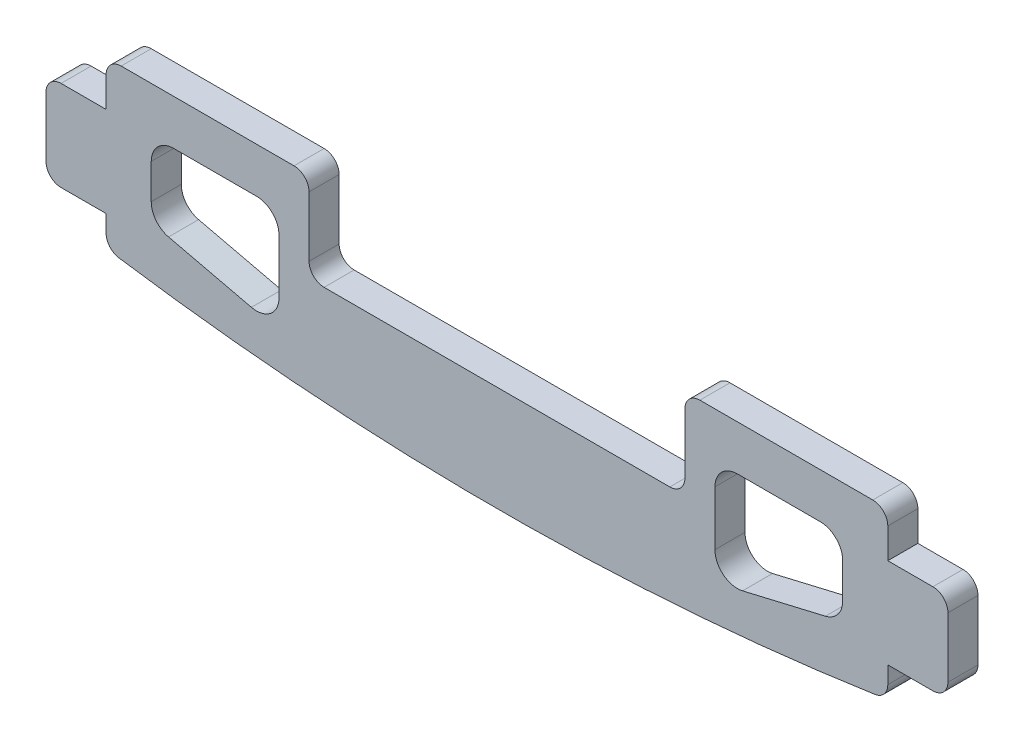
ISO-10303-21;
HEADER;
FILE_DESCRIPTION(('STEP AP214'),'2;1');
FILE_NAME('part.step','',(''),(''),'','','');
FILE_SCHEMA(('AUTOMOTIVE_DESIGN { 1 0 10303 214 1 1 1 1 }'));
ENDSEC;
DATA;
#1=APPLICATION_CONTEXT('core data for automotive mechanical design processes');
#2=APPLICATION_PROTOCOL_DEFINITION('international standard','automotive_design',2000,#1);
#3=PRODUCT_CONTEXT('',#1,'mechanical');
#4=PRODUCT('Part','Part','',(#3));
#5=PRODUCT_RELATED_PRODUCT_CATEGORY('part','',(#4));
#6=PRODUCT_DEFINITION_FORMATION('','',#4);
#7=PRODUCT_DEFINITION_CONTEXT('part definition',#1,'design');
#8=PRODUCT_DEFINITION('design','',#6,#7);
#9=PRODUCT_DEFINITION_SHAPE('','',#8);
#10=(LENGTH_UNIT() NAMED_UNIT(*) SI_UNIT(.MILLI.,.METRE.));
#11=(NAMED_UNIT(*) PLANE_ANGLE_UNIT() SI_UNIT($,.RADIAN.));
#12=(NAMED_UNIT(*) SI_UNIT($,.STERADIAN.) SOLID_ANGLE_UNIT());
#13=UNCERTAINTY_MEASURE_WITH_UNIT(LENGTH_MEASURE(1.E-05),#10,'distance_accuracy_value','');
#14=(GEOMETRIC_REPRESENTATION_CONTEXT(3) GLOBAL_UNCERTAINTY_ASSIGNED_CONTEXT((#13)) GLOBAL_UNIT_ASSIGNED_CONTEXT((#10,
#11,#12)) REPRESENTATION_CONTEXT('',''));
#15=CARTESIAN_POINT('',(0.,0.,0.));
#16=DIRECTION('',(0.,0.,1.));
#17=DIRECTION('',(1.,0.,0.));
#18=AXIS2_PLACEMENT_3D('',#15,#16,#17);
#19=CARTESIAN_POINT('',(29.,2.,2.));
#20=DIRECTION('',(0.,0.,-1.));
#21=DIRECTION('',(-1.,0.,0.));
#22=AXIS2_PLACEMENT_3D('',#19,#20,#21);
#23=PLANE('',#22);
#24=CARTESIAN_POINT('',(21.5059690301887,1.50596903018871,2.));
#25=DIRECTION('',(0.,0.,1.));
#26=DIRECTION('',(-1.,0.,0.));
#27=AXIS2_PLACEMENT_3D('',#24,#25,#26);
#28=CIRCLE('',#27,1.49403096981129);
#29=CARTESIAN_POINT('',(23.,1.5059690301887,2.));
#30=VERTEX_POINT('',#29);
#31=CARTESIAN_POINT('',(21.5059690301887,3.,2.));
#32=VERTEX_POINT('',#31);
#33=EDGE_CURVE('E378',#30,#32,#28,.T.);
#34=ORIENTED_EDGE('',*,*,#33,.F.);
#35=DIRECTION('',(0.,1.,0.));
#36=VECTOR('',#35,1.);
#37=CARTESIAN_POINT('',(23.,1.5059690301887,2.));
#38=LINE('',#37,#36);
#39=CARTESIAN_POINT('',(23.,-0.816705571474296,2.));
#40=VERTEX_POINT('',#39);
#41=EDGE_CURVE('E394',#40,#30,#38,.T.);
#42=ORIENTED_EDGE('',*,*,#41,.F.);
#43=CARTESIAN_POINT('',(21.5059690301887,-0.816705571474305,2.));
#44=DIRECTION('',(0.,0.,1.));
#45=DIRECTION('',(-1.,0.,0.));
#46=AXIS2_PLACEMENT_3D('',#43,#44,#45);
#47=CIRCLE('',#46,1.49403096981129);
#48=CARTESIAN_POINT('',(21.8481608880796,-2.27102096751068,2.));
#49=VERTEX_POINT('',#48);
#50=EDGE_CURVE('E391',#49,#40,#47,.T.);
#51=ORIENTED_EDGE('',*,*,#50,.F.);
#52=DIRECTION('',(0.973417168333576,0.229039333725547,0.));
#53=VECTOR('',#52,1.);
#54=CARTESIAN_POINT('',(21.8481608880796,-2.27102096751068,2.));
#55=LINE('',#54,#53);
#56=CARTESIAN_POINT('',(16.3362228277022,-3.56794756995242,2.));
#57=VERTEX_POINT('',#56);
#58=EDGE_CURVE('E389',#57,#49,#55,.T.);
#59=ORIENTED_EDGE('',*,*,#58,.F.);
#60=CARTESIAN_POINT('',(15.9940309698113,-2.11363217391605,2.));
#61=DIRECTION('',(0.,0.,1.));
#62=DIRECTION('',(-1.,0.,0.));
#63=AXIS2_PLACEMENT_3D('',#60,#61,#62);
#64=CIRCLE('',#63,1.49403096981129);
#65=CARTESIAN_POINT('',(14.5,-2.11363217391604,2.));
#66=VERTEX_POINT('',#65);
#67=EDGE_CURVE('E387',#66,#57,#64,.T.);
#68=ORIENTED_EDGE('',*,*,#67,.F.);
#69=DIRECTION('',(0.,-1.,0.));
#70=VECTOR('',#69,1.);
#71=CARTESIAN_POINT('',(14.5,-2.11363217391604,2.));
#72=LINE('',#71,#70);
#73=CARTESIAN_POINT('',(14.5,1.5059690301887,2.));
#74=VERTEX_POINT('',#73);
#75=EDGE_CURVE('E385',#74,#66,#72,.T.);
#76=ORIENTED_EDGE('',*,*,#75,.F.);
#77=CARTESIAN_POINT('',(15.9940309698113,1.50596903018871,2.));
#78=DIRECTION('',(0.,0.,1.));
#79=DIRECTION('',(1.,0.,0.));
#80=AXIS2_PLACEMENT_3D('',#77,#78,#79);
#81=CIRCLE('',#80,1.49403096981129);
#82=CARTESIAN_POINT('',(15.9940309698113,3.,2.));
#83=VERTEX_POINT('',#82);
#84=EDGE_CURVE('E383',#83,#74,#81,.T.);
#85=ORIENTED_EDGE('',*,*,#84,.F.);
#86=DIRECTION('',(-1.,0.,0.));
#87=VECTOR('',#86,1.);
#88=CARTESIAN_POINT('',(15.9940309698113,3.,2.));
#89=LINE('',#88,#87);
#90=EDGE_CURVE('E380',#32,#83,#89,.T.);
#91=ORIENTED_EDGE('',*,*,#90,.F.);
#92=EDGE_LOOP('',(#34,#42,#51,#59,#68,#76,#85,#91));
#93=FACE_BOUND('',#92,.T.);
#94=DIRECTION('',(-1.,0.,0.));
#95=VECTOR('',#94,1.);
#96=CARTESIAN_POINT('',(26.,3.,2.));
#97=LINE('',#96,#95);
#98=CARTESIAN_POINT('',(29.,3.,2.));
#99=VERTEX_POINT('',#98);
#100=CARTESIAN_POINT('',(26.,3.,2.));
#101=VERTEX_POINT('',#100);
#102=EDGE_CURVE('E437',#99,#101,#97,.T.);
#103=ORIENTED_EDGE('',*,*,#102,.T.);
#104=DIRECTION('',(0.,1.,0.));
#105=VECTOR('',#104,1.);
#106=CARTESIAN_POINT('',(26.,4.99999999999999,2.));
#107=LINE('',#106,#105);
#108=CARTESIAN_POINT('',(26.,4.99999999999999,2.));
#109=VERTEX_POINT('',#108);
#110=EDGE_CURVE('E440',#101,#109,#107,.T.);
#111=ORIENTED_EDGE('',*,*,#110,.T.);
#112=CARTESIAN_POINT('',(25.,5.,2.));
#113=DIRECTION('',(0.,0.,1.));
#114=DIRECTION('',(-1.,0.,0.));
#115=AXIS2_PLACEMENT_3D('',#112,#113,#114);
#116=CIRCLE('',#115,1.);
#117=CARTESIAN_POINT('',(25.,6.,2.));
#118=VERTEX_POINT('',#117);
#119=EDGE_CURVE('E443',#109,#118,#116,.T.);
#120=ORIENTED_EDGE('',*,*,#119,.T.);
#121=DIRECTION('',(-1.,0.,0.));
#122=VECTOR('',#121,1.);
#123=CARTESIAN_POINT('',(13.5,6.,2.));
#124=LINE('',#123,#122);
#125=CARTESIAN_POINT('',(13.5,6.,2.));
#126=VERTEX_POINT('',#125);
#127=EDGE_CURVE('E445',#118,#126,#124,.T.);
#128=ORIENTED_EDGE('',*,*,#127,.T.);
#129=CARTESIAN_POINT('',(13.5,5.,2.));
#130=DIRECTION('',(0.,0.,1.));
#131=DIRECTION('',(-1.,0.,0.));
#132=AXIS2_PLACEMENT_3D('',#129,#130,#131);
#133=CIRCLE('',#132,1.);
#134=CARTESIAN_POINT('',(12.5,4.99999999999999,2.));
#135=VERTEX_POINT('',#134);
#136=EDGE_CURVE('E447',#126,#135,#133,.T.);
#137=ORIENTED_EDGE('',*,*,#136,.T.);
#138=DIRECTION('',(0.,-1.,0.));
#139=VECTOR('',#138,1.);
#140=CARTESIAN_POINT('',(12.5,1.00000000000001,2.));
#141=LINE('',#140,#139);
#142=CARTESIAN_POINT('',(12.5,1.00000000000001,2.));
#143=VERTEX_POINT('',#142);
#144=EDGE_CURVE('E449',#135,#143,#141,.T.);
#145=ORIENTED_EDGE('',*,*,#144,.T.);
#146=CARTESIAN_POINT('',(11.5,1.,2.));
#147=DIRECTION('',(0.,0.,-1.));
#148=DIRECTION('',(1.,0.,0.));
#149=AXIS2_PLACEMENT_3D('',#146,#147,#148);
#150=CIRCLE('',#149,1.);
#151=CARTESIAN_POINT('',(11.5,0.,2.));
#152=VERTEX_POINT('',#151);
#153=EDGE_CURVE('E451',#143,#152,#150,.T.);
#154=ORIENTED_EDGE('',*,*,#153,.T.);
#155=DIRECTION('',(-1.,0.,0.));
#156=VECTOR('',#155,1.);
#157=CARTESIAN_POINT('',(-11.5,0.,2.));
#158=LINE('',#157,#156);
#159=CARTESIAN_POINT('',(-11.5,0.,2.));
#160=VERTEX_POINT('',#159);
#161=EDGE_CURVE('E453',#152,#160,#158,.T.);
#162=ORIENTED_EDGE('',*,*,#161,.T.);
#163=CARTESIAN_POINT('',(-11.5,1.,2.));
#164=DIRECTION('',(0.,0.,-1.));
#165=DIRECTION('',(-1.,0.,0.));
#166=AXIS2_PLACEMENT_3D('',#163,#164,#165);
#167=CIRCLE('',#166,1.);
#168=CARTESIAN_POINT('',(-12.5,1.00000000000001,2.));
#169=VERTEX_POINT('',#168);
#170=EDGE_CURVE('E455',#160,#169,#167,.T.);
#171=ORIENTED_EDGE('',*,*,#170,.T.);
#172=DIRECTION('',(0.,1.,0.));
#173=VECTOR('',#172,1.);
#174=CARTESIAN_POINT('',(-12.5,1.00000000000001,2.));
#175=LINE('',#174,#173);
#176=CARTESIAN_POINT('',(-12.5,4.99999999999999,2.));
#177=VERTEX_POINT('',#176);
#178=EDGE_CURVE('E457',#169,#177,#175,.T.);
#179=ORIENTED_EDGE('',*,*,#178,.T.);
#180=CARTESIAN_POINT('',(-13.5,5.,2.));
#181=DIRECTION('',(0.,0.,1.));
#182=DIRECTION('',(1.,0.,0.));
#183=AXIS2_PLACEMENT_3D('',#180,#181,#182);
#184=CIRCLE('',#183,1.);
#185=CARTESIAN_POINT('',(-13.5,6.,2.));
#186=VERTEX_POINT('',#185);
#187=EDGE_CURVE('E459',#177,#186,#184,.T.);
#188=ORIENTED_EDGE('',*,*,#187,.T.);
#189=DIRECTION('',(-1.,0.,0.));
#190=VECTOR('',#189,1.);
#191=CARTESIAN_POINT('',(-13.5,6.,2.));
#192=LINE('',#191,#190);
#193=CARTESIAN_POINT('',(-25.,6.,2.));
#194=VERTEX_POINT('',#193);
#195=EDGE_CURVE('E461',#186,#194,#192,.T.);
#196=ORIENTED_EDGE('',*,*,#195,.T.);
#197=CARTESIAN_POINT('',(-25.,5.,2.));
#198=DIRECTION('',(0.,0.,1.));
#199=DIRECTION('',(1.,0.,0.));
#200=AXIS2_PLACEMENT_3D('',#197,#198,#199);
#201=CIRCLE('',#200,1.);
#202=CARTESIAN_POINT('',(-26.,4.99999999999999,2.));
#203=VERTEX_POINT('',#202);
#204=EDGE_CURVE('E463',#194,#203,#201,.T.);
#205=ORIENTED_EDGE('',*,*,#204,.T.);
#206=DIRECTION('',(0.,-1.,0.));
#207=VECTOR('',#206,1.);
#208=CARTESIAN_POINT('',(-26.,4.99999999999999,2.));
#209=LINE('',#208,#207);
#210=CARTESIAN_POINT('',(-26.,3.,2.));
#211=VERTEX_POINT('',#210);
#212=EDGE_CURVE('E465',#203,#211,#209,.T.);
#213=ORIENTED_EDGE('',*,*,#212,.T.);
#214=DIRECTION('',(-1.,0.,0.));
#215=VECTOR('',#214,1.);
#216=CARTESIAN_POINT('',(-26.,3.,2.));
#217=LINE('',#216,#215);
#218=CARTESIAN_POINT('',(-29.,3.,2.));
#219=VERTEX_POINT('',#218);
#220=EDGE_CURVE('E467',#211,#219,#217,.T.);
#221=ORIENTED_EDGE('',*,*,#220,.T.);
#222=CARTESIAN_POINT('',(-29.,2.,2.));
#223=DIRECTION('',(0.,0.,1.));
#224=DIRECTION('',(1.,0.,0.));
#225=AXIS2_PLACEMENT_3D('',#222,#223,#224);
#226=CIRCLE('',#225,1.);
#227=CARTESIAN_POINT('',(-30.,1.99999999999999,2.));
#228=VERTEX_POINT('',#227);
#229=EDGE_CURVE('E469',#219,#228,#226,.T.);
#230=ORIENTED_EDGE('',*,*,#229,.T.);
#231=DIRECTION('',(0.,-1.,0.));
#232=VECTOR('',#231,1.);
#233=CARTESIAN_POINT('',(-30.,1.99999999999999,2.));
#234=LINE('',#233,#232);
#235=CARTESIAN_POINT('',(-30.,-1.99999999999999,2.));
#236=VERTEX_POINT('',#235);
#237=EDGE_CURVE('E471',#228,#236,#234,.T.);
#238=ORIENTED_EDGE('',*,*,#237,.T.);
#239=CARTESIAN_POINT('',(-29.,-2.,2.));
#240=DIRECTION('',(0.,0.,1.));
#241=DIRECTION('',(1.,0.,0.));
#242=AXIS2_PLACEMENT_3D('',#239,#240,#241);
#243=CIRCLE('',#242,1.);
#244=CARTESIAN_POINT('',(-29.,-3.,2.));
#245=VERTEX_POINT('',#244);
#246=EDGE_CURVE('E473',#236,#245,#243,.T.);
#247=ORIENTED_EDGE('',*,*,#246,.T.);
#248=DIRECTION('',(1.,0.,0.));
#249=VECTOR('',#248,1.);
#250=CARTESIAN_POINT('',(-29.,-3.,2.));
#251=LINE('',#250,#249);
#252=CARTESIAN_POINT('',(-26.,-3.,2.));
#253=VERTEX_POINT('',#252);
#254=EDGE_CURVE('E475',#245,#253,#251,.T.);
#255=ORIENTED_EDGE('',*,*,#254,.T.);
#256=DIRECTION('',(0.,-1.,0.));
#257=VECTOR('',#256,1.);
#258=CARTESIAN_POINT('',(-26.,-3.,2.));
#259=LINE('',#258,#257);
#260=CARTESIAN_POINT('',(-26.,-4.14065932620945,2.));
#261=VERTEX_POINT('',#260);
#262=EDGE_CURVE('E477',#253,#261,#259,.T.);
#263=ORIENTED_EDGE('',*,*,#262,.T.);
#264=CARTESIAN_POINT('',(-25.,-4.14065932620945,2.));
#265=DIRECTION('',(0.,0.,1.));
#266=DIRECTION('',(1.,0.,0.));
#267=AXIS2_PLACEMENT_3D('',#264,#265,#266);
#268=CIRCLE('',#267,1.);
#269=CARTESIAN_POINT('',(-25.1479289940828,-5.1296573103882,2.));
#270=VERTEX_POINT('',#269);
#271=EDGE_CURVE('E479',#261,#270,#268,.T.);
#272=ORIENTED_EDGE('',*,*,#271,.T.);
#273=CARTESIAN_POINT('',(0.,163.,2.));
#274=DIRECTION('',(0.,0.,1.));
#275=DIRECTION('',(1.,0.,0.));
#276=AXIS2_PLACEMENT_3D('',#273,#274,#275);
#277=CIRCLE('',#276,170.);
#278=CARTESIAN_POINT('',(25.147928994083,-5.12965731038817,2.));
#279=VERTEX_POINT('',#278);
#280=EDGE_CURVE('E481',#270,#279,#277,.T.);
#281=ORIENTED_EDGE('',*,*,#280,.T.);
#282=CARTESIAN_POINT('',(25.,-4.14065932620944,2.));
#283=DIRECTION('',(0.,0.,1.));
#284=DIRECTION('',(-1.,0.,0.));
#285=AXIS2_PLACEMENT_3D('',#282,#283,#284);
#286=CIRCLE('',#285,1.);
#287=CARTESIAN_POINT('',(26.,-4.14065932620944,2.));
#288=VERTEX_POINT('',#287);
#289=EDGE_CURVE('E483',#279,#288,#286,.T.);
#290=ORIENTED_EDGE('',*,*,#289,.T.);
#291=DIRECTION('',(0.,1.,0.));
#292=VECTOR('',#291,1.);
#293=CARTESIAN_POINT('',(26.,-3.,2.));
#294=LINE('',#293,#292);
#295=CARTESIAN_POINT('',(26.,-3.,2.));
#296=VERTEX_POINT('',#295);
#297=EDGE_CURVE('E485',#288,#296,#294,.T.);
#298=ORIENTED_EDGE('',*,*,#297,.T.);
#299=DIRECTION('',(1.,0.,0.));
#300=VECTOR('',#299,1.);
#301=CARTESIAN_POINT('',(29.,-3.,2.));
#302=LINE('',#301,#300);
#303=CARTESIAN_POINT('',(29.,-3.,2.));
#304=VERTEX_POINT('',#303);
#305=EDGE_CURVE('E487',#296,#304,#302,.T.);
#306=ORIENTED_EDGE('',*,*,#305,.T.);
#307=CARTESIAN_POINT('',(29.,-2.,2.));
#308=DIRECTION('',(0.,0.,1.));
#309=DIRECTION('',(-1.,0.,0.));
#310=AXIS2_PLACEMENT_3D('',#307,#308,#309);
#311=CIRCLE('',#310,1.);
#312=CARTESIAN_POINT('',(30.,-1.99999999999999,2.));
#313=VERTEX_POINT('',#312);
#314=EDGE_CURVE('E489',#304,#313,#311,.T.);
#315=ORIENTED_EDGE('',*,*,#314,.T.);
#316=DIRECTION('',(0.,1.,0.));
#317=VECTOR('',#316,1.);
#318=CARTESIAN_POINT('',(30.,1.99999999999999,2.));
#319=LINE('',#318,#317);
#320=CARTESIAN_POINT('',(30.,1.99999999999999,2.));
#321=VERTEX_POINT('',#320);
#322=EDGE_CURVE('E491',#313,#321,#319,.T.);
#323=ORIENTED_EDGE('',*,*,#322,.T.);
#324=CARTESIAN_POINT('',(29.,2.,2.));
#325=DIRECTION('',(0.,0.,1.));
#326=DIRECTION('',(-1.,0.,0.));
#327=AXIS2_PLACEMENT_3D('',#324,#325,#326);
#328=CIRCLE('',#327,1.);
#329=EDGE_CURVE('E493',#321,#99,#328,.T.);
#330=ORIENTED_EDGE('',*,*,#329,.T.);
#331=EDGE_LOOP('',(#103,#111,#120,#128,#137,#145,#154,#162,#171,#179,#188,#196,#205,#213,#221,
#230,#238,#247,#255,#263,#272,#281,#290,#298,#306,#315,#323,#330));
#332=FACE_BOUND('',#331,.T.);
#333=CARTESIAN_POINT('',(-15.9940309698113,-2.11363217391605,2.));
#334=DIRECTION('',(0.,0.,1.));
#335=DIRECTION('',(1.,0.,0.));
#336=AXIS2_PLACEMENT_3D('',#333,#334,#335);
#337=CIRCLE('',#336,1.49403096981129);
#338=CARTESIAN_POINT('',(-16.3362228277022,-3.56794756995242,2.));
#339=VERTEX_POINT('',#338);
#340=CARTESIAN_POINT('',(-14.5,-2.11363217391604,2.));
#341=VERTEX_POINT('',#340);
#342=EDGE_CURVE('E313',#339,#341,#337,.T.);
#343=ORIENTED_EDGE('',*,*,#342,.F.);
#344=DIRECTION('',(0.973417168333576,-0.229039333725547,0.));
#345=VECTOR('',#344,1.);
#346=CARTESIAN_POINT('',(-21.8481608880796,-2.27102096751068,2.));
#347=LINE('',#346,#345);
#348=CARTESIAN_POINT('',(-21.8481608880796,-2.27102096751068,2.));
#349=VERTEX_POINT('',#348);
#350=EDGE_CURVE('E346',#349,#339,#347,.T.);
#351=ORIENTED_EDGE('',*,*,#350,.F.);
#352=CARTESIAN_POINT('',(-21.5059690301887,-0.816705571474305,2.));
#353=DIRECTION('',(0.,0.,1.));
#354=DIRECTION('',(1.,0.,0.));
#355=AXIS2_PLACEMENT_3D('',#352,#353,#354);
#356=CIRCLE('',#355,1.49403096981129);
#357=CARTESIAN_POINT('',(-23.,-0.816705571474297,2.));
#358=VERTEX_POINT('',#357);
#359=EDGE_CURVE('E344',#358,#349,#356,.T.);
#360=ORIENTED_EDGE('',*,*,#359,.F.);
#361=DIRECTION('',(0.,-1.,0.));
#362=VECTOR('',#361,1.);
#363=CARTESIAN_POINT('',(-23.,1.5059690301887,2.));
#364=LINE('',#363,#362);
#365=CARTESIAN_POINT('',(-23.,1.5059690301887,2.));
#366=VERTEX_POINT('',#365);
#367=EDGE_CURVE('E342',#366,#358,#364,.T.);
#368=ORIENTED_EDGE('',*,*,#367,.F.);
#369=CARTESIAN_POINT('',(-21.5059690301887,1.50596903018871,2.));
#370=DIRECTION('',(0.,0.,1.));
#371=DIRECTION('',(1.,0.,0.));
#372=AXIS2_PLACEMENT_3D('',#369,#370,#371);
#373=CIRCLE('',#372,1.49403096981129);
#374=CARTESIAN_POINT('',(-21.5059690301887,3.,2.));
#375=VERTEX_POINT('',#374);
#376=EDGE_CURVE('E340',#375,#366,#373,.T.);
#377=ORIENTED_EDGE('',*,*,#376,.F.);
#378=DIRECTION('',(-1.,0.,0.));
#379=VECTOR('',#378,1.);
#380=CARTESIAN_POINT('',(-15.9940309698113,3.,2.));
#381=LINE('',#380,#379);
#382=CARTESIAN_POINT('',(-15.9940309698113,3.,2.));
#383=VERTEX_POINT('',#382);
#384=EDGE_CURVE('E336',#383,#375,#381,.T.);
#385=ORIENTED_EDGE('',*,*,#384,.F.);
#386=CARTESIAN_POINT('',(-15.9940309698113,1.50596903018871,2.));
#387=DIRECTION('',(0.,0.,1.));
#388=DIRECTION('',(-1.,0.,0.));
#389=AXIS2_PLACEMENT_3D('',#386,#387,#388);
#390=CIRCLE('',#389,1.49403096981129);
#391=CARTESIAN_POINT('',(-14.5,1.5059690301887,2.));
#392=VERTEX_POINT('',#391);
#393=EDGE_CURVE('E334',#392,#383,#390,.T.);
#394=ORIENTED_EDGE('',*,*,#393,.F.);
#395=DIRECTION('',(0.,1.,0.));
#396=VECTOR('',#395,1.);
#397=CARTESIAN_POINT('',(-14.5,-2.11363217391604,2.));
#398=LINE('',#397,#396);
#399=EDGE_CURVE('E321',#341,#392,#398,.T.);
#400=ORIENTED_EDGE('',*,*,#399,.F.);
#401=EDGE_LOOP('',(#343,#351,#360,#368,#377,#385,#394,#400));
#402=FACE_BOUND('',#401,.T.);
#403=ADVANCED_FACE('F32',(#93,#332,#402),#23,.F.);
#404=CARTESIAN_POINT('',(29.,2.,0.));
#405=DIRECTION('',(0.,0.,-1.));
#406=DIRECTION('',(-1.,0.,0.));
#407=AXIS2_PLACEMENT_3D('',#404,#405,#406);
#408=PLANE('',#407);
#409=DIRECTION('',(0.,1.,0.));
#410=VECTOR('',#409,1.);
#411=CARTESIAN_POINT('',(23.,1.5059690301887,0.));
#412=LINE('',#411,#410);
#413=CARTESIAN_POINT('',(23.,-0.816705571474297,0.));
#414=VERTEX_POINT('',#413);
#415=CARTESIAN_POINT('',(23.,1.5059690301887,0.));
#416=VERTEX_POINT('',#415);
#417=EDGE_CURVE('E381',#414,#416,#412,.T.);
#418=ORIENTED_EDGE('',*,*,#417,.T.);
#419=CARTESIAN_POINT('',(21.5059690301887,1.50596903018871,0.));
#420=DIRECTION('',(0.,0.,1.));
#421=DIRECTION('',(-1.,0.,0.));
#422=AXIS2_PLACEMENT_3D('',#419,#420,#421);
#423=CIRCLE('',#422,1.49403096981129);
#424=CARTESIAN_POINT('',(21.5059690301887,3.,0.));
#425=VERTEX_POINT('',#424);
#426=EDGE_CURVE('E329',#416,#425,#423,.T.);
#427=ORIENTED_EDGE('',*,*,#426,.T.);
#428=DIRECTION('',(-1.,0.,0.));
#429=VECTOR('',#428,1.);
#430=CARTESIAN_POINT('',(15.9940309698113,3.,0.));
#431=LINE('',#430,#429);
#432=CARTESIAN_POINT('',(15.9940309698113,3.,0.));
#433=VERTEX_POINT('',#432);
#434=EDGE_CURVE('E399',#425,#433,#431,.T.);
#435=ORIENTED_EDGE('',*,*,#434,.T.);
#436=CARTESIAN_POINT('',(15.9940309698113,1.50596903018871,0.));
#437=DIRECTION('',(0.,0.,1.));
#438=DIRECTION('',(1.,0.,0.));
#439=AXIS2_PLACEMENT_3D('',#436,#437,#438);
#440=CIRCLE('',#439,1.49403096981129);
#441=CARTESIAN_POINT('',(14.5,1.5059690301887,0.));
#442=VERTEX_POINT('',#441);
#443=EDGE_CURVE('E402',#433,#442,#440,.T.);
#444=ORIENTED_EDGE('',*,*,#443,.T.);
#445=DIRECTION('',(0.,-1.,0.));
#446=VECTOR('',#445,1.);
#447=CARTESIAN_POINT('',(14.5,-2.11363217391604,0.));
#448=LINE('',#447,#446);
#449=CARTESIAN_POINT('',(14.5,-2.11363217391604,0.));
#450=VERTEX_POINT('',#449);
#451=EDGE_CURVE('E405',#442,#450,#448,.T.);
#452=ORIENTED_EDGE('',*,*,#451,.T.);
#453=CARTESIAN_POINT('',(15.9940309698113,-2.11363217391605,0.));
#454=DIRECTION('',(0.,0.,1.));
#455=DIRECTION('',(-1.,0.,0.));
#456=AXIS2_PLACEMENT_3D('',#453,#454,#455);
#457=CIRCLE('',#456,1.49403096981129);
#458=CARTESIAN_POINT('',(16.3362228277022,-3.56794756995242,0.));
#459=VERTEX_POINT('',#458);
#460=EDGE_CURVE('E408',#450,#459,#457,.T.);
#461=ORIENTED_EDGE('',*,*,#460,.T.);
#462=DIRECTION('',(0.973417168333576,0.229039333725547,0.));
#463=VECTOR('',#462,1.);
#464=CARTESIAN_POINT('',(21.8481608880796,-2.27102096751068,0.));
#465=LINE('',#464,#463);
#466=CARTESIAN_POINT('',(21.8481608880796,-2.27102096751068,0.));
#467=VERTEX_POINT('',#466);
#468=EDGE_CURVE('E411',#459,#467,#465,.T.);
#469=ORIENTED_EDGE('',*,*,#468,.T.);
#470=CARTESIAN_POINT('',(21.5059690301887,-0.816705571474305,0.));
#471=DIRECTION('',(0.,0.,1.));
#472=DIRECTION('',(-1.,0.,0.));
#473=AXIS2_PLACEMENT_3D('',#470,#471,#472);
#474=CIRCLE('',#473,1.49403096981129);
#475=EDGE_CURVE('E414',#467,#414,#474,.T.);
#476=ORIENTED_EDGE('',*,*,#475,.T.);
#477=EDGE_LOOP('',(#418,#427,#435,#444,#452,#461,#469,#476));
#478=FACE_BOUND('',#477,.T.);
#479=DIRECTION('',(-1.,0.,0.));
#480=VECTOR('',#479,1.);
#481=CARTESIAN_POINT('',(26.,3.,0.));
#482=LINE('',#481,#480);
#483=CARTESIAN_POINT('',(29.,3.,0.));
#484=VERTEX_POINT('',#483);
#485=CARTESIAN_POINT('',(26.,3.,0.));
#486=VERTEX_POINT('',#485);
#487=EDGE_CURVE('E436',#484,#486,#482,.T.);
#488=ORIENTED_EDGE('',*,*,#487,.F.);
#489=CARTESIAN_POINT('',(29.,2.,0.));
#490=DIRECTION('',(0.,0.,1.));
#491=DIRECTION('',(-1.,0.,0.));
#492=AXIS2_PLACEMENT_3D('',#489,#490,#491);
#493=CIRCLE('',#492,1.);
#494=CARTESIAN_POINT('',(30.,1.99999999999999,0.));
#495=VERTEX_POINT('',#494);
#496=EDGE_CURVE('E441',#495,#484,#493,.T.);
#497=ORIENTED_EDGE('',*,*,#496,.F.);
#498=DIRECTION('',(0.,1.,0.));
#499=VECTOR('',#498,1.);
#500=CARTESIAN_POINT('',(30.,1.99999999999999,0.));
#501=LINE('',#500,#499);
#502=CARTESIAN_POINT('',(30.,-1.99999999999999,0.));
#503=VERTEX_POINT('',#502);
#504=EDGE_CURVE('E549',#503,#495,#501,.T.);
#505=ORIENTED_EDGE('',*,*,#504,.F.);
#506=CARTESIAN_POINT('',(29.,-2.,0.));
#507=DIRECTION('',(0.,0.,1.));
#508=DIRECTION('',(-1.,0.,0.));
#509=AXIS2_PLACEMENT_3D('',#506,#507,#508);
#510=CIRCLE('',#509,1.);
#511=CARTESIAN_POINT('',(29.,-3.,0.));
#512=VERTEX_POINT('',#511);
#513=EDGE_CURVE('E547',#512,#503,#510,.T.);
#514=ORIENTED_EDGE('',*,*,#513,.F.);
#515=DIRECTION('',(1.,0.,0.));
#516=VECTOR('',#515,1.);
#517=CARTESIAN_POINT('',(29.,-3.,0.));
#518=LINE('',#517,#516);
#519=CARTESIAN_POINT('',(26.,-3.,0.));
#520=VERTEX_POINT('',#519);
#521=EDGE_CURVE('E545',#520,#512,#518,.T.);
#522=ORIENTED_EDGE('',*,*,#521,.F.);
#523=DIRECTION('',(0.,1.,0.));
#524=VECTOR('',#523,1.);
#525=CARTESIAN_POINT('',(26.,-3.,0.));
#526=LINE('',#525,#524);
#527=CARTESIAN_POINT('',(26.,-4.14065932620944,0.));
#528=VERTEX_POINT('',#527);
#529=EDGE_CURVE('E543',#528,#520,#526,.T.);
#530=ORIENTED_EDGE('',*,*,#529,.F.);
#531=CARTESIAN_POINT('',(25.,-4.14065932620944,0.));
#532=DIRECTION('',(0.,0.,1.));
#533=DIRECTION('',(-1.,0.,0.));
#534=AXIS2_PLACEMENT_3D('',#531,#532,#533);
#535=CIRCLE('',#534,1.);
#536=CARTESIAN_POINT('',(25.147928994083,-5.12965731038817,0.));
#537=VERTEX_POINT('',#536);
#538=EDGE_CURVE('E541',#537,#528,#535,.T.);
#539=ORIENTED_EDGE('',*,*,#538,.F.);
#540=CARTESIAN_POINT('',(0.,163.,0.));
#541=DIRECTION('',(0.,0.,1.));
#542=DIRECTION('',(-1.,0.,0.));
#543=AXIS2_PLACEMENT_3D('',#540,#541,#542);
#544=CIRCLE('',#543,170.);
#545=CARTESIAN_POINT('',(-25.1479289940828,-5.1296573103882,0.));
#546=VERTEX_POINT('',#545);
#547=EDGE_CURVE('E539',#546,#537,#544,.T.);
#548=ORIENTED_EDGE('',*,*,#547,.F.);
#549=CARTESIAN_POINT('',(-25.,-4.14065932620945,0.));
#550=DIRECTION('',(0.,0.,1.));
#551=DIRECTION('',(1.,0.,0.));
#552=AXIS2_PLACEMENT_3D('',#549,#550,#551);
#553=CIRCLE('',#552,1.);
#554=CARTESIAN_POINT('',(-26.,-4.14065932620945,0.));
#555=VERTEX_POINT('',#554);
#556=EDGE_CURVE('E536',#555,#546,#553,.T.);
#557=ORIENTED_EDGE('',*,*,#556,.F.);
#558=DIRECTION('',(0.,-1.,0.));
#559=VECTOR('',#558,1.);
#560=CARTESIAN_POINT('',(-26.,-3.,0.));
#561=LINE('',#560,#559);
#562=CARTESIAN_POINT('',(-26.,-3.,0.));
#563=VERTEX_POINT('',#562);
#564=EDGE_CURVE('E534',#563,#555,#561,.T.);
#565=ORIENTED_EDGE('',*,*,#564,.F.);
#566=DIRECTION('',(1.,0.,0.));
#567=VECTOR('',#566,1.);
#568=CARTESIAN_POINT('',(-29.,-3.,0.));
#569=LINE('',#568,#567);
#570=CARTESIAN_POINT('',(-29.,-3.,0.));
#571=VERTEX_POINT('',#570);
#572=EDGE_CURVE('E532',#571,#563,#569,.T.);
#573=ORIENTED_EDGE('',*,*,#572,.F.);
#574=CARTESIAN_POINT('',(-29.,-2.,0.));
#575=DIRECTION('',(0.,0.,1.));
#576=DIRECTION('',(1.,0.,0.));
#577=AXIS2_PLACEMENT_3D('',#574,#575,#576);
#578=CIRCLE('',#577,1.);
#579=CARTESIAN_POINT('',(-30.,-1.99999999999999,0.));
#580=VERTEX_POINT('',#579);
#581=EDGE_CURVE('E530',#580,#571,#578,.T.);
#582=ORIENTED_EDGE('',*,*,#581,.F.);
#583=DIRECTION('',(0.,-1.,0.));
#584=VECTOR('',#583,1.);
#585=CARTESIAN_POINT('',(-30.,1.99999999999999,0.));
#586=LINE('',#585,#584);
#587=CARTESIAN_POINT('',(-30.,1.99999999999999,0.));
#588=VERTEX_POINT('',#587);
#589=EDGE_CURVE('E528',#588,#580,#586,.T.);
#590=ORIENTED_EDGE('',*,*,#589,.F.);
#591=CARTESIAN_POINT('',(-29.,2.,0.));
#592=DIRECTION('',(0.,0.,1.));
#593=DIRECTION('',(1.,0.,0.));
#594=AXIS2_PLACEMENT_3D('',#591,#592,#593);
#595=CIRCLE('',#594,1.);
#596=CARTESIAN_POINT('',(-29.,3.,0.));
#597=VERTEX_POINT('',#596);
#598=EDGE_CURVE('E526',#597,#588,#595,.T.);
#599=ORIENTED_EDGE('',*,*,#598,.F.);
#600=DIRECTION('',(-1.,0.,0.));
#601=VECTOR('',#600,1.);
#602=CARTESIAN_POINT('',(-26.,3.,0.));
#603=LINE('',#602,#601);
#604=CARTESIAN_POINT('',(-26.,3.,0.));
#605=VERTEX_POINT('',#604);
#606=EDGE_CURVE('E524',#605,#597,#603,.T.);
#607=ORIENTED_EDGE('',*,*,#606,.F.);
#608=DIRECTION('',(0.,-1.,0.));
#609=VECTOR('',#608,1.);
#610=CARTESIAN_POINT('',(-26.,4.99999999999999,0.));
#611=LINE('',#610,#609);
#612=CARTESIAN_POINT('',(-26.,4.99999999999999,0.));
#613=VERTEX_POINT('',#612);
#614=EDGE_CURVE('E522',#613,#605,#611,.T.);
#615=ORIENTED_EDGE('',*,*,#614,.F.);
#616=CARTESIAN_POINT('',(-25.,5.,0.));
#617=DIRECTION('',(0.,0.,1.));
#618=DIRECTION('',(1.,0.,0.));
#619=AXIS2_PLACEMENT_3D('',#616,#617,#618);
#620=CIRCLE('',#619,1.);
#621=CARTESIAN_POINT('',(-25.,6.,0.));
#622=VERTEX_POINT('',#621);
#623=EDGE_CURVE('E520',#622,#613,#620,.T.);
#624=ORIENTED_EDGE('',*,*,#623,.F.);
#625=DIRECTION('',(-1.,0.,0.));
#626=VECTOR('',#625,1.);
#627=CARTESIAN_POINT('',(-13.5,6.,0.));
#628=LINE('',#627,#626);
#629=CARTESIAN_POINT('',(-13.5,6.,0.));
#630=VERTEX_POINT('',#629);
#631=EDGE_CURVE('E518',#630,#622,#628,.T.);
#632=ORIENTED_EDGE('',*,*,#631,.F.);
#633=CARTESIAN_POINT('',(-13.5,5.,0.));
#634=DIRECTION('',(0.,0.,1.));
#635=DIRECTION('',(1.,0.,0.));
#636=AXIS2_PLACEMENT_3D('',#633,#634,#635);
#637=CIRCLE('',#636,1.);
#638=CARTESIAN_POINT('',(-12.5,4.99999999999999,0.));
#639=VERTEX_POINT('',#638);
#640=EDGE_CURVE('E516',#639,#630,#637,.T.);
#641=ORIENTED_EDGE('',*,*,#640,.F.);
#642=DIRECTION('',(0.,1.,0.));
#643=VECTOR('',#642,1.);
#644=CARTESIAN_POINT('',(-12.5,1.00000000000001,0.));
#645=LINE('',#644,#643);
#646=CARTESIAN_POINT('',(-12.5,1.00000000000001,0.));
#647=VERTEX_POINT('',#646);
#648=EDGE_CURVE('E514',#647,#639,#645,.T.);
#649=ORIENTED_EDGE('',*,*,#648,.F.);
#650=CARTESIAN_POINT('',(-11.5,1.,0.));
#651=DIRECTION('',(0.,0.,-1.));
#652=DIRECTION('',(-1.,0.,0.));
#653=AXIS2_PLACEMENT_3D('',#650,#651,#652);
#654=CIRCLE('',#653,1.);
#655=CARTESIAN_POINT('',(-11.5,0.,0.));
#656=VERTEX_POINT('',#655);
#657=EDGE_CURVE('E512',#656,#647,#654,.T.);
#658=ORIENTED_EDGE('',*,*,#657,.F.);
#659=DIRECTION('',(-1.,0.,0.));
#660=VECTOR('',#659,1.);
#661=CARTESIAN_POINT('',(-11.5,0.,0.));
#662=LINE('',#661,#660);
#663=CARTESIAN_POINT('',(11.5,0.,0.));
#664=VERTEX_POINT('',#663);
#665=EDGE_CURVE('E510',#664,#656,#662,.T.);
#666=ORIENTED_EDGE('',*,*,#665,.F.);
#667=CARTESIAN_POINT('',(11.5,1.,0.));
#668=DIRECTION('',(0.,0.,-1.));
#669=DIRECTION('',(1.,0.,0.));
#670=AXIS2_PLACEMENT_3D('',#667,#668,#669);
#671=CIRCLE('',#670,1.);
#672=CARTESIAN_POINT('',(12.5,1.00000000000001,0.));
#673=VERTEX_POINT('',#672);
#674=EDGE_CURVE('E508',#673,#664,#671,.T.);
#675=ORIENTED_EDGE('',*,*,#674,.F.);
#676=DIRECTION('',(0.,-1.,0.));
#677=VECTOR('',#676,1.);
#678=CARTESIAN_POINT('',(12.5,1.00000000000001,0.));
#679=LINE('',#678,#677);
#680=CARTESIAN_POINT('',(12.5,4.99999999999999,0.));
#681=VERTEX_POINT('',#680);
#682=EDGE_CURVE('E506',#681,#673,#679,.T.);
#683=ORIENTED_EDGE('',*,*,#682,.F.);
#684=CARTESIAN_POINT('',(13.5,5.,0.));
#685=DIRECTION('',(0.,0.,1.));
#686=DIRECTION('',(-1.,0.,0.));
#687=AXIS2_PLACEMENT_3D('',#684,#685,#686);
#688=CIRCLE('',#687,1.);
#689=CARTESIAN_POINT('',(13.5,6.,0.));
#690=VERTEX_POINT('',#689);
#691=EDGE_CURVE('E504',#690,#681,#688,.T.);
#692=ORIENTED_EDGE('',*,*,#691,.F.);
#693=DIRECTION('',(-1.,0.,0.));
#694=VECTOR('',#693,1.);
#695=CARTESIAN_POINT('',(13.5,6.,0.));
#696=LINE('',#695,#694);
#697=CARTESIAN_POINT('',(25.,6.,0.));
#698=VERTEX_POINT('',#697);
#699=EDGE_CURVE('E502',#698,#690,#696,.T.);
#700=ORIENTED_EDGE('',*,*,#699,.F.);
#701=CARTESIAN_POINT('',(25.,5.,0.));
#702=DIRECTION('',(0.,0.,1.));
#703=DIRECTION('',(-1.,0.,0.));
#704=AXIS2_PLACEMENT_3D('',#701,#702,#703);
#705=CIRCLE('',#704,1.);
#706=CARTESIAN_POINT('',(26.,4.99999999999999,0.));
#707=VERTEX_POINT('',#706);
#708=EDGE_CURVE('E500',#707,#698,#705,.T.);
#709=ORIENTED_EDGE('',*,*,#708,.F.);
#710=DIRECTION('',(0.,1.,0.));
#711=VECTOR('',#710,1.);
#712=CARTESIAN_POINT('',(26.,4.99999999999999,0.));
#713=LINE('',#712,#711);
#714=EDGE_CURVE('E498',#486,#707,#713,.T.);
#715=ORIENTED_EDGE('',*,*,#714,.F.);
#716=EDGE_LOOP('',(#488,#497,#505,#514,#522,#530,#539,#548,#557,#565,#573,#582,#590,#599,#607,
#615,#624,#632,#641,#649,#658,#666,#675,#683,#692,#700,#709,#715));
#717=FACE_BOUND('',#716,.T.);
#718=DIRECTION('',(0.973417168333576,-0.229039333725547,0.));
#719=VECTOR('',#718,1.);
#720=CARTESIAN_POINT('',(-21.8481608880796,-2.27102096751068,0.));
#721=LINE('',#720,#719);
#722=CARTESIAN_POINT('',(-21.8481608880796,-2.27102096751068,0.));
#723=VERTEX_POINT('',#722);
#724=CARTESIAN_POINT('',(-16.3362228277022,-3.56794756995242,0.));
#725=VERTEX_POINT('',#724);
#726=EDGE_CURVE('E322',#723,#725,#721,.T.);
#727=ORIENTED_EDGE('',*,*,#726,.T.);
#728=CARTESIAN_POINT('',(-15.9940309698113,-2.11363217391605,0.));
#729=DIRECTION('',(0.,0.,1.));
#730=DIRECTION('',(1.,0.,0.));
#731=AXIS2_PLACEMENT_3D('',#728,#729,#730);
#732=CIRCLE('',#731,1.49403096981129);
#733=CARTESIAN_POINT('',(-14.5,-2.11363217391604,0.));
#734=VERTEX_POINT('',#733);
#735=EDGE_CURVE('E55',#725,#734,#732,.T.);
#736=ORIENTED_EDGE('',*,*,#735,.T.);
#737=DIRECTION('',(0.,1.,0.));
#738=VECTOR('',#737,1.);
#739=CARTESIAN_POINT('',(-14.5,-2.11363217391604,0.));
#740=LINE('',#739,#738);
#741=CARTESIAN_POINT('',(-14.5,1.5059690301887,0.));
#742=VERTEX_POINT('',#741);
#743=EDGE_CURVE('E328',#734,#742,#740,.T.);
#744=ORIENTED_EDGE('',*,*,#743,.T.);
#745=CARTESIAN_POINT('',(-15.9940309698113,1.50596903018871,0.));
#746=DIRECTION('',(0.,0.,1.));
#747=DIRECTION('',(-1.,0.,0.));
#748=AXIS2_PLACEMENT_3D('',#745,#746,#747);
#749=CIRCLE('',#748,1.49403096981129);
#750=CARTESIAN_POINT('',(-15.9940309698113,3.,0.));
#751=VERTEX_POINT('',#750);
#752=EDGE_CURVE('E350',#742,#751,#749,.T.);
#753=ORIENTED_EDGE('',*,*,#752,.T.);
#754=DIRECTION('',(-1.,0.,0.));
#755=VECTOR('',#754,1.);
#756=CARTESIAN_POINT('',(-15.9940309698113,3.,0.));
#757=LINE('',#756,#755);
#758=CARTESIAN_POINT('',(-21.5059690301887,3.,0.));
#759=VERTEX_POINT('',#758);
#760=EDGE_CURVE('E353',#751,#759,#757,.T.);
#761=ORIENTED_EDGE('',*,*,#760,.T.);
#762=CARTESIAN_POINT('',(-21.5059690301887,1.50596903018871,0.));
#763=DIRECTION('',(0.,0.,1.));
#764=DIRECTION('',(1.,0.,0.));
#765=AXIS2_PLACEMENT_3D('',#762,#763,#764);
#766=CIRCLE('',#765,1.49403096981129);
#767=CARTESIAN_POINT('',(-23.,1.5059690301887,0.));
#768=VERTEX_POINT('',#767);
#769=EDGE_CURVE('E356',#759,#768,#766,.T.);
#770=ORIENTED_EDGE('',*,*,#769,.T.);
#771=DIRECTION('',(0.,-1.,0.));
#772=VECTOR('',#771,1.);
#773=CARTESIAN_POINT('',(-23.,1.5059690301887,0.));
#774=LINE('',#773,#772);
#775=CARTESIAN_POINT('',(-23.,-0.816705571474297,0.));
#776=VERTEX_POINT('',#775);
#777=EDGE_CURVE('E359',#768,#776,#774,.T.);
#778=ORIENTED_EDGE('',*,*,#777,.T.);
#779=CARTESIAN_POINT('',(-21.5059690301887,-0.816705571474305,0.));
#780=DIRECTION('',(0.,0.,1.));
#781=DIRECTION('',(1.,0.,0.));
#782=AXIS2_PLACEMENT_3D('',#779,#780,#781);
#783=CIRCLE('',#782,1.49403096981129);
#784=EDGE_CURVE('E362',#776,#723,#783,.T.);
#785=ORIENTED_EDGE('',*,*,#784,.T.);
#786=EDGE_LOOP('',(#727,#736,#744,#753,#761,#770,#778,#785));
#787=FACE_BOUND('',#786,.T.);
#788=ADVANCED_FACE('F639',(#478,#717,#787),#408,.T.);
#789=CARTESIAN_POINT('',(26.,3.,2.));
#790=DIRECTION('',(0.,-1.,0.));
#791=DIRECTION('',(0.,0.,-1.));
#792=AXIS2_PLACEMENT_3D('',#789,#790,#791);
#793=PLANE('',#792);
#794=ORIENTED_EDGE('',*,*,#487,.T.);
#795=DIRECTION('',(0.,0.,-1.));
#796=VECTOR('',#795,1.);
#797=CARTESIAN_POINT('',(26.,3.,2.));
#798=LINE('',#797,#796);
#799=EDGE_CURVE('E11',#101,#486,#798,.T.);
#800=ORIENTED_EDGE('',*,*,#799,.F.);
#801=ORIENTED_EDGE('',*,*,#102,.F.);
#802=DIRECTION('',(0.,0.,-1.));
#803=VECTOR('',#802,1.);
#804=CARTESIAN_POINT('',(29.,3.,2.));
#805=LINE('',#804,#803);
#806=EDGE_CURVE('E495',#99,#484,#805,.T.);
#807=ORIENTED_EDGE('',*,*,#806,.T.);
#808=EDGE_LOOP('',(#794,#800,#801,#807));
#809=FACE_BOUND('',#808,.T.);
#810=ADVANCED_FACE('F34',(#809),#793,.F.);
#811=CARTESIAN_POINT('',(26.,4.99999999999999,2.));
#812=DIRECTION('',(-1.,0.,0.));
#813=DIRECTION('',(0.,0.,1.));
#814=AXIS2_PLACEMENT_3D('',#811,#812,#813);
#815=PLANE('',#814);
#816=ORIENTED_EDGE('',*,*,#714,.T.);
#817=DIRECTION('',(0.,0.,-1.));
#818=VECTOR('',#817,1.);
#819=CARTESIAN_POINT('',(26.,4.99999999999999,2.));
#820=LINE('',#819,#818);
#821=EDGE_CURVE('E40',#109,#707,#820,.T.);
#822=ORIENTED_EDGE('',*,*,#821,.F.);
#823=ORIENTED_EDGE('',*,*,#110,.F.);
#824=ORIENTED_EDGE('',*,*,#799,.T.);
#825=EDGE_LOOP('',(#816,#822,#823,#824));
#826=FACE_BOUND('',#825,.T.);
#827=ADVANCED_FACE('F656',(#826),#815,.F.);
#828=CARTESIAN_POINT('',(25.,5.,2.));
#829=DIRECTION('',(0.,0.,-1.));
#830=DIRECTION('',(-1.,0.,0.));
#831=AXIS2_PLACEMENT_3D('',#828,#829,#830);
#832=CYLINDRICAL_SURFACE('',#831,1.);
#833=ORIENTED_EDGE('',*,*,#708,.T.);
#834=DIRECTION('',(0.,0.,-1.));
#835=VECTOR('',#834,1.);
#836=CARTESIAN_POINT('',(25.,6.,2.));
#837=LINE('',#836,#835);
#838=EDGE_CURVE('E626',#118,#698,#837,.T.);
#839=ORIENTED_EDGE('',*,*,#838,.F.);
#840=ORIENTED_EDGE('',*,*,#119,.F.);
#841=ORIENTED_EDGE('',*,*,#821,.T.);
#842=EDGE_LOOP('',(#833,#839,#840,#841));
#843=FACE_BOUND('',#842,.T.);
#844=ADVANCED_FACE('F633',(#843),#832,.T.);
#845=CARTESIAN_POINT('',(13.5,6.,2.));
#846=DIRECTION('',(0.,-1.,0.));
#847=DIRECTION('',(0.,0.,-1.));
#848=AXIS2_PLACEMENT_3D('',#845,#846,#847);
#849=PLANE('',#848);
#850=ORIENTED_EDGE('',*,*,#699,.T.);
#851=DIRECTION('',(0.,0.,-1.));
#852=VECTOR('',#851,1.);
#853=CARTESIAN_POINT('',(13.5,6.,2.));
#854=LINE('',#853,#852);
#855=EDGE_CURVE('E623',#126,#690,#854,.T.);
#856=ORIENTED_EDGE('',*,*,#855,.F.);
#857=ORIENTED_EDGE('',*,*,#127,.F.);
#858=ORIENTED_EDGE('',*,*,#838,.T.);
#859=EDGE_LOOP('',(#850,#856,#857,#858));
#860=FACE_BOUND('',#859,.T.);
#861=ADVANCED_FACE('F645',(#860),#849,.F.);
#862=CARTESIAN_POINT('',(13.5,5.,2.));
#863=DIRECTION('',(0.,0.,-1.));
#864=DIRECTION('',(-1.,0.,0.));
#865=AXIS2_PLACEMENT_3D('',#862,#863,#864);
#866=CYLINDRICAL_SURFACE('',#865,1.);
#867=ORIENTED_EDGE('',*,*,#691,.T.);
#868=DIRECTION('',(0.,0.,-1.));
#869=VECTOR('',#868,1.);
#870=CARTESIAN_POINT('',(12.5,4.99999999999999,2.));
#871=LINE('',#870,#869);
#872=EDGE_CURVE('E620',#135,#681,#871,.T.);
#873=ORIENTED_EDGE('',*,*,#872,.F.);
#874=ORIENTED_EDGE('',*,*,#136,.F.);
#875=ORIENTED_EDGE('',*,*,#855,.T.);
#876=EDGE_LOOP('',(#867,#873,#874,#875));
#877=FACE_BOUND('',#876,.T.);
#878=ADVANCED_FACE('F649',(#877),#866,.T.);
#879=CARTESIAN_POINT('',(12.5,1.00000000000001,2.));
#880=DIRECTION('',(1.,0.,0.));
#881=DIRECTION('',(0.,0.,-1.));
#882=AXIS2_PLACEMENT_3D('',#879,#880,#881);
#883=PLANE('',#882);
#884=ORIENTED_EDGE('',*,*,#682,.T.);
#885=DIRECTION('',(0.,0.,-1.));
#886=VECTOR('',#885,1.);
#887=CARTESIAN_POINT('',(12.5,1.00000000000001,2.));
#888=LINE('',#887,#886);
#889=EDGE_CURVE('E617',#143,#673,#888,.T.);
#890=ORIENTED_EDGE('',*,*,#889,.F.);
#891=ORIENTED_EDGE('',*,*,#144,.F.);
#892=ORIENTED_EDGE('',*,*,#872,.T.);
#893=EDGE_LOOP('',(#884,#890,#891,#892));
#894=FACE_BOUND('',#893,.T.);
#895=ADVANCED_FACE('F768',(#894),#883,.F.);
#896=CARTESIAN_POINT('',(11.5,1.,2.));
#897=DIRECTION('',(0.,0.,-1.));
#898=DIRECTION('',(-1.,0.,0.));
#899=AXIS2_PLACEMENT_3D('',#896,#897,#898);
#900=CYLINDRICAL_SURFACE('',#899,1.);
#901=ORIENTED_EDGE('',*,*,#674,.T.);
#902=DIRECTION('',(0.,0.,-1.));
#903=VECTOR('',#902,1.);
#904=CARTESIAN_POINT('',(11.5,0.,2.));
#905=LINE('',#904,#903);
#906=EDGE_CURVE('E614',#152,#664,#905,.T.);
#907=ORIENTED_EDGE('',*,*,#906,.F.);
#908=ORIENTED_EDGE('',*,*,#153,.F.);
#909=ORIENTED_EDGE('',*,*,#889,.T.);
#910=EDGE_LOOP('',(#901,#907,#908,#909));
#911=FACE_BOUND('',#910,.T.);
#912=ADVANCED_FACE('F765',(#911),#900,.F.);
#913=CARTESIAN_POINT('',(-11.5,0.,2.));
#914=DIRECTION('',(0.,-1.,0.));
#915=DIRECTION('',(0.,0.,-1.));
#916=AXIS2_PLACEMENT_3D('',#913,#914,#915);
#917=PLANE('',#916);
#918=ORIENTED_EDGE('',*,*,#665,.T.);
#919=DIRECTION('',(0.,0.,-1.));
#920=VECTOR('',#919,1.);
#921=CARTESIAN_POINT('',(-11.5,0.,2.));
#922=LINE('',#921,#920);
#923=EDGE_CURVE('E611',#160,#656,#922,.T.);
#924=ORIENTED_EDGE('',*,*,#923,.F.);
#925=ORIENTED_EDGE('',*,*,#161,.F.);
#926=ORIENTED_EDGE('',*,*,#906,.T.);
#927=EDGE_LOOP('',(#918,#924,#925,#926));
#928=FACE_BOUND('',#927,.T.);
#929=ADVANCED_FACE('F761',(#928),#917,.F.);
#930=CARTESIAN_POINT('',(-11.5,1.,2.));
#931=DIRECTION('',(0.,0.,-1.));
#932=DIRECTION('',(-1.,0.,0.));
#933=AXIS2_PLACEMENT_3D('',#930,#931,#932);
#934=CYLINDRICAL_SURFACE('',#933,1.);
#935=ORIENTED_EDGE('',*,*,#657,.T.);
#936=DIRECTION('',(0.,0.,-1.));
#937=VECTOR('',#936,1.);
#938=CARTESIAN_POINT('',(-12.5,1.00000000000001,2.));
#939=LINE('',#938,#937);
#940=EDGE_CURVE('E608',#169,#647,#939,.T.);
#941=ORIENTED_EDGE('',*,*,#940,.F.);
#942=ORIENTED_EDGE('',*,*,#170,.F.);
#943=ORIENTED_EDGE('',*,*,#923,.T.);
#944=EDGE_LOOP('',(#935,#941,#942,#943));
#945=FACE_BOUND('',#944,.T.);
#946=ADVANCED_FACE('F757',(#945),#934,.F.);
#947=CARTESIAN_POINT('',(-12.5,1.00000000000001,2.));
#948=DIRECTION('',(-1.,0.,0.));
#949=DIRECTION('',(0.,0.,1.));
#950=AXIS2_PLACEMENT_3D('',#947,#948,#949);
#951=PLANE('',#950);
#952=ORIENTED_EDGE('',*,*,#648,.T.);
#953=DIRECTION('',(0.,0.,-1.));
#954=VECTOR('',#953,1.);
#955=CARTESIAN_POINT('',(-12.5,4.99999999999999,2.));
#956=LINE('',#955,#954);
#957=EDGE_CURVE('E605',#177,#639,#956,.T.);
#958=ORIENTED_EDGE('',*,*,#957,.F.);
#959=ORIENTED_EDGE('',*,*,#178,.F.);
#960=ORIENTED_EDGE('',*,*,#940,.T.);
#961=EDGE_LOOP('',(#952,#958,#959,#960));
#962=FACE_BOUND('',#961,.T.);
#963=ADVANCED_FACE('F752',(#962),#951,.F.);
#964=CARTESIAN_POINT('',(-13.5,5.,2.));
#965=DIRECTION('',(0.,0.,-1.));
#966=DIRECTION('',(-1.,0.,0.));
#967=AXIS2_PLACEMENT_3D('',#964,#965,#966);
#968=CYLINDRICAL_SURFACE('',#967,1.);
#969=ORIENTED_EDGE('',*,*,#640,.T.);
#970=DIRECTION('',(0.,0.,-1.));
#971=VECTOR('',#970,1.);
#972=CARTESIAN_POINT('',(-13.5,6.,2.));
#973=LINE('',#972,#971);
#974=EDGE_CURVE('E602',#186,#630,#973,.T.);
#975=ORIENTED_EDGE('',*,*,#974,.F.);
#976=ORIENTED_EDGE('',*,*,#187,.F.);
#977=ORIENTED_EDGE('',*,*,#957,.T.);
#978=EDGE_LOOP('',(#969,#975,#976,#977));
#979=FACE_BOUND('',#978,.T.);
#980=ADVANCED_FACE('F746',(#979),#968,.T.);
#981=CARTESIAN_POINT('',(-13.5,6.,2.));
#982=DIRECTION('',(0.,-1.,0.));
#983=DIRECTION('',(0.,0.,-1.));
#984=AXIS2_PLACEMENT_3D('',#981,#982,#983);
#985=PLANE('',#984);
#986=ORIENTED_EDGE('',*,*,#631,.T.);
#987=DIRECTION('',(0.,0.,-1.));
#988=VECTOR('',#987,1.);
#989=CARTESIAN_POINT('',(-25.,6.,2.));
#990=LINE('',#989,#988);
#991=EDGE_CURVE('E599',#194,#622,#990,.T.);
#992=ORIENTED_EDGE('',*,*,#991,.F.);
#993=ORIENTED_EDGE('',*,*,#195,.F.);
#994=ORIENTED_EDGE('',*,*,#974,.T.);
#995=EDGE_LOOP('',(#986,#992,#993,#994));
#996=FACE_BOUND('',#995,.T.);
#997=ADVANCED_FACE('F742',(#996),#985,.F.);
#998=CARTESIAN_POINT('',(-25.,5.,2.));
#999=DIRECTION('',(0.,0.,-1.));
#1000=DIRECTION('',(-1.,0.,0.));
#1001=AXIS2_PLACEMENT_3D('',#998,#999,#1000);
#1002=CYLINDRICAL_SURFACE('',#1001,1.);
#1003=ORIENTED_EDGE('',*,*,#623,.T.);
#1004=DIRECTION('',(0.,0.,-1.));
#1005=VECTOR('',#1004,1.);
#1006=CARTESIAN_POINT('',(-26.,4.99999999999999,2.));
#1007=LINE('',#1006,#1005);
#1008=EDGE_CURVE('E596',#203,#613,#1007,.T.);
#1009=ORIENTED_EDGE('',*,*,#1008,.F.);
#1010=ORIENTED_EDGE('',*,*,#204,.F.);
#1011=ORIENTED_EDGE('',*,*,#991,.T.);
#1012=EDGE_LOOP('',(#1003,#1009,#1010,#1011));
#1013=FACE_BOUND('',#1012,.T.);
#1014=ADVANCED_FACE('F737',(#1013),#1002,.T.);
#1015=CARTESIAN_POINT('',(-26.,4.99999999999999,2.));
#1016=DIRECTION('',(1.,0.,0.));
#1017=DIRECTION('',(0.,0.,-1.));
#1018=AXIS2_PLACEMENT_3D('',#1015,#1016,#1017);
#1019=PLANE('',#1018);
#1020=ORIENTED_EDGE('',*,*,#614,.T.);
#1021=DIRECTION('',(0.,0.,-1.));
#1022=VECTOR('',#1021,1.);
#1023=CARTESIAN_POINT('',(-26.,3.,2.));
#1024=LINE('',#1023,#1022);
#1025=EDGE_CURVE('E593',#211,#605,#1024,.T.);
#1026=ORIENTED_EDGE('',*,*,#1025,.F.);
#1027=ORIENTED_EDGE('',*,*,#212,.F.);
#1028=ORIENTED_EDGE('',*,*,#1008,.T.);
#1029=EDGE_LOOP('',(#1020,#1026,#1027,#1028));
#1030=FACE_BOUND('',#1029,.T.);
#1031=ADVANCED_FACE('F731',(#1030),#1019,.F.);
#1032=CARTESIAN_POINT('',(-26.,3.,2.));
#1033=DIRECTION('',(0.,-1.,0.));
#1034=DIRECTION('',(0.,0.,-1.));
#1035=AXIS2_PLACEMENT_3D('',#1032,#1033,#1034);
#1036=PLANE('',#1035);
#1037=ORIENTED_EDGE('',*,*,#606,.T.);
#1038=DIRECTION('',(0.,0.,-1.));
#1039=VECTOR('',#1038,1.);
#1040=CARTESIAN_POINT('',(-29.,3.,2.));
#1041=LINE('',#1040,#1039);
#1042=EDGE_CURVE('E590',#219,#597,#1041,.T.);
#1043=ORIENTED_EDGE('',*,*,#1042,.F.);
#1044=ORIENTED_EDGE('',*,*,#220,.F.);
#1045=ORIENTED_EDGE('',*,*,#1025,.T.);
#1046=EDGE_LOOP('',(#1037,#1043,#1044,#1045));
#1047=FACE_BOUND('',#1046,.T.);
#1048=ADVANCED_FACE('F727',(#1047),#1036,.F.);
#1049=CARTESIAN_POINT('',(-29.,2.,2.));
#1050=DIRECTION('',(0.,0.,-1.));
#1051=DIRECTION('',(-1.,0.,0.));
#1052=AXIS2_PLACEMENT_3D('',#1049,#1050,#1051);
#1053=CYLINDRICAL_SURFACE('',#1052,1.);
#1054=ORIENTED_EDGE('',*,*,#598,.T.);
#1055=DIRECTION('',(0.,0.,-1.));
#1056=VECTOR('',#1055,1.);
#1057=CARTESIAN_POINT('',(-30.,1.99999999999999,2.));
#1058=LINE('',#1057,#1056);
#1059=EDGE_CURVE('E587',#228,#588,#1058,.T.);
#1060=ORIENTED_EDGE('',*,*,#1059,.F.);
#1061=ORIENTED_EDGE('',*,*,#229,.F.);
#1062=ORIENTED_EDGE('',*,*,#1042,.T.);
#1063=EDGE_LOOP('',(#1054,#1060,#1061,#1062));
#1064=FACE_BOUND('',#1063,.T.);
#1065=ADVANCED_FACE('F722',(#1064),#1053,.T.);
#1066=CARTESIAN_POINT('',(-30.,1.99999999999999,2.));
#1067=DIRECTION('',(1.,0.,0.));
#1068=DIRECTION('',(0.,0.,-1.));
#1069=AXIS2_PLACEMENT_3D('',#1066,#1067,#1068);
#1070=PLANE('',#1069);
#1071=ORIENTED_EDGE('',*,*,#589,.T.);
#1072=DIRECTION('',(0.,0.,-1.));
#1073=VECTOR('',#1072,1.);
#1074=CARTESIAN_POINT('',(-30.,-1.99999999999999,2.));
#1075=LINE('',#1074,#1073);
#1076=EDGE_CURVE('E584',#236,#580,#1075,.T.);
#1077=ORIENTED_EDGE('',*,*,#1076,.F.);
#1078=ORIENTED_EDGE('',*,*,#237,.F.);
#1079=ORIENTED_EDGE('',*,*,#1059,.T.);
#1080=EDGE_LOOP('',(#1071,#1077,#1078,#1079));
#1081=FACE_BOUND('',#1080,.T.);
#1082=ADVANCED_FACE('F716',(#1081),#1070,.F.);
#1083=CARTESIAN_POINT('',(-29.,-2.,2.));
#1084=DIRECTION('',(0.,0.,-1.));
#1085=DIRECTION('',(-1.,0.,0.));
#1086=AXIS2_PLACEMENT_3D('',#1083,#1084,#1085);
#1087=CYLINDRICAL_SURFACE('',#1086,1.);
#1088=ORIENTED_EDGE('',*,*,#581,.T.);
#1089=DIRECTION('',(0.,0.,-1.));
#1090=VECTOR('',#1089,1.);
#1091=CARTESIAN_POINT('',(-29.,-3.,2.));
#1092=LINE('',#1091,#1090);
#1093=EDGE_CURVE('E581',#245,#571,#1092,.T.);
#1094=ORIENTED_EDGE('',*,*,#1093,.F.);
#1095=ORIENTED_EDGE('',*,*,#246,.F.);
#1096=ORIENTED_EDGE('',*,*,#1076,.T.);
#1097=EDGE_LOOP('',(#1088,#1094,#1095,#1096));
#1098=FACE_BOUND('',#1097,.T.);
#1099=ADVANCED_FACE('F712',(#1098),#1087,.T.);
#1100=CARTESIAN_POINT('',(-29.,-3.,2.));
#1101=DIRECTION('',(0.,1.,0.));
#1102=DIRECTION('',(-1.,0.,0.));
#1103=AXIS2_PLACEMENT_3D('',#1100,#1101,#1102);
#1104=PLANE('',#1103);
#1105=ORIENTED_EDGE('',*,*,#572,.T.);
#1106=DIRECTION('',(0.,0.,-1.));
#1107=VECTOR('',#1106,1.);
#1108=CARTESIAN_POINT('',(-26.,-3.,2.));
#1109=LINE('',#1108,#1107);
#1110=EDGE_CURVE('E578',#253,#563,#1109,.T.);
#1111=ORIENTED_EDGE('',*,*,#1110,.F.);
#1112=ORIENTED_EDGE('',*,*,#254,.F.);
#1113=ORIENTED_EDGE('',*,*,#1093,.T.);
#1114=EDGE_LOOP('',(#1105,#1111,#1112,#1113));
#1115=FACE_BOUND('',#1114,.T.);
#1116=ADVANCED_FACE('F708',(#1115),#1104,.F.);
#1117=CARTESIAN_POINT('',(-26.,-3.,2.));
#1118=DIRECTION('',(1.,0.,0.));
#1119=DIRECTION('',(0.,0.,-1.));
#1120=AXIS2_PLACEMENT_3D('',#1117,#1118,#1119);
#1121=PLANE('',#1120);
#1122=ORIENTED_EDGE('',*,*,#564,.T.);
#1123=DIRECTION('',(0.,0.,-1.));
#1124=VECTOR('',#1123,1.);
#1125=CARTESIAN_POINT('',(-26.,-4.14065932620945,2.));
#1126=LINE('',#1125,#1124);
#1127=EDGE_CURVE('E575',#261,#555,#1126,.T.);
#1128=ORIENTED_EDGE('',*,*,#1127,.F.);
#1129=ORIENTED_EDGE('',*,*,#262,.F.);
#1130=ORIENTED_EDGE('',*,*,#1110,.T.);
#1131=EDGE_LOOP('',(#1122,#1128,#1129,#1130));
#1132=FACE_BOUND('',#1131,.T.);
#1133=ADVANCED_FACE('F703',(#1132),#1121,.F.);
#1134=CARTESIAN_POINT('',(-25.,-4.14065932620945,2.));
#1135=DIRECTION('',(0.,0.,-1.));
#1136=DIRECTION('',(-1.,0.,0.));
#1137=AXIS2_PLACEMENT_3D('',#1134,#1135,#1136);
#1138=CYLINDRICAL_SURFACE('',#1137,1.);
#1139=ORIENTED_EDGE('',*,*,#556,.T.);
#1140=DIRECTION('',(0.,0.,-1.));
#1141=VECTOR('',#1140,1.);
#1142=CARTESIAN_POINT('',(-25.1479289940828,-5.1296573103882,2.));
#1143=LINE('',#1142,#1141);
#1144=EDGE_CURVE('E572',#270,#546,#1143,.T.);
#1145=ORIENTED_EDGE('',*,*,#1144,.F.);
#1146=ORIENTED_EDGE('',*,*,#271,.F.);
#1147=ORIENTED_EDGE('',*,*,#1127,.T.);
#1148=EDGE_LOOP('',(#1139,#1145,#1146,#1147));
#1149=FACE_BOUND('',#1148,.T.);
#1150=ADVANCED_FACE('F694',(#1149),#1138,.T.);
#1151=CARTESIAN_POINT('',(0.,163.,2.));
#1152=DIRECTION('',(0.,0.,-1.));
#1153=DIRECTION('',(-1.,0.,0.));
#1154=AXIS2_PLACEMENT_3D('',#1151,#1152,#1153);
#1155=CYLINDRICAL_SURFACE('',#1154,170.);
#1156=ORIENTED_EDGE('',*,*,#547,.T.);
#1157=DIRECTION('',(0.,0.,-1.));
#1158=VECTOR('',#1157,1.);
#1159=CARTESIAN_POINT('',(25.147928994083,-5.12965731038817,2.));
#1160=LINE('',#1159,#1158);
#1161=EDGE_CURVE('E569',#279,#537,#1160,.T.);
#1162=ORIENTED_EDGE('',*,*,#1161,.F.);
#1163=ORIENTED_EDGE('',*,*,#280,.F.);
#1164=ORIENTED_EDGE('',*,*,#1144,.T.);
#1165=EDGE_LOOP('',(#1156,#1162,#1163,#1164));
#1166=FACE_BOUND('',#1165,.T.);
#1167=ADVANCED_FACE('F698',(#1166),#1155,.T.);
#1168=CARTESIAN_POINT('',(25.,-4.14065932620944,2.));
#1169=DIRECTION('',(0.,0.,-1.));
#1170=DIRECTION('',(-1.,0.,0.));
#1171=AXIS2_PLACEMENT_3D('',#1168,#1169,#1170);
#1172=CYLINDRICAL_SURFACE('',#1171,1.);
#1173=ORIENTED_EDGE('',*,*,#538,.T.);
#1174=DIRECTION('',(0.,0.,-1.));
#1175=VECTOR('',#1174,1.);
#1176=CARTESIAN_POINT('',(26.,-4.14065932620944,2.));
#1177=LINE('',#1176,#1175);
#1178=EDGE_CURVE('E566',#288,#528,#1177,.T.);
#1179=ORIENTED_EDGE('',*,*,#1178,.F.);
#1180=ORIENTED_EDGE('',*,*,#289,.F.);
#1181=ORIENTED_EDGE('',*,*,#1161,.T.);
#1182=EDGE_LOOP('',(#1173,#1179,#1180,#1181));
#1183=FACE_BOUND('',#1182,.T.);
#1184=ADVANCED_FACE('F687',(#1183),#1172,.T.);
#1185=CARTESIAN_POINT('',(26.,-3.,2.));
#1186=DIRECTION('',(-1.,0.,0.));
#1187=DIRECTION('',(0.,0.,1.));
#1188=AXIS2_PLACEMENT_3D('',#1185,#1186,#1187);
#1189=PLANE('',#1188);
#1190=ORIENTED_EDGE('',*,*,#529,.T.);
#1191=DIRECTION('',(0.,0.,-1.));
#1192=VECTOR('',#1191,1.);
#1193=CARTESIAN_POINT('',(26.,-3.,2.));
#1194=LINE('',#1193,#1192);
#1195=EDGE_CURVE('E563',#296,#520,#1194,.T.);
#1196=ORIENTED_EDGE('',*,*,#1195,.F.);
#1197=ORIENTED_EDGE('',*,*,#297,.F.);
#1198=ORIENTED_EDGE('',*,*,#1178,.T.);
#1199=EDGE_LOOP('',(#1190,#1196,#1197,#1198));
#1200=FACE_BOUND('',#1199,.T.);
#1201=ADVANCED_FACE('F683',(#1200),#1189,.F.);
#1202=CARTESIAN_POINT('',(29.,-3.,2.));
#1203=DIRECTION('',(0.,1.,0.));
#1204=DIRECTION('',(-1.,0.,0.));
#1205=AXIS2_PLACEMENT_3D('',#1202,#1203,#1204);
#1206=PLANE('',#1205);
#1207=ORIENTED_EDGE('',*,*,#521,.T.);
#1208=DIRECTION('',(0.,0.,-1.));
#1209=VECTOR('',#1208,1.);
#1210=CARTESIAN_POINT('',(29.,-3.,2.));
#1211=LINE('',#1210,#1209);
#1212=EDGE_CURVE('E560',#304,#512,#1211,.T.);
#1213=ORIENTED_EDGE('',*,*,#1212,.F.);
#1214=ORIENTED_EDGE('',*,*,#305,.F.);
#1215=ORIENTED_EDGE('',*,*,#1195,.T.);
#1216=EDGE_LOOP('',(#1207,#1213,#1214,#1215));
#1217=FACE_BOUND('',#1216,.T.);
#1218=ADVANCED_FACE('F678',(#1217),#1206,.F.);
#1219=CARTESIAN_POINT('',(29.,-2.,2.));
#1220=DIRECTION('',(0.,0.,-1.));
#1221=DIRECTION('',(-1.,0.,0.));
#1222=AXIS2_PLACEMENT_3D('',#1219,#1220,#1221);
#1223=CYLINDRICAL_SURFACE('',#1222,1.);
#1224=ORIENTED_EDGE('',*,*,#513,.T.);
#1225=DIRECTION('',(0.,0.,-1.));
#1226=VECTOR('',#1225,1.);
#1227=CARTESIAN_POINT('',(30.,-1.99999999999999,2.));
#1228=LINE('',#1227,#1226);
#1229=EDGE_CURVE('E557',#313,#503,#1228,.T.);
#1230=ORIENTED_EDGE('',*,*,#1229,.F.);
#1231=ORIENTED_EDGE('',*,*,#314,.F.);
#1232=ORIENTED_EDGE('',*,*,#1212,.T.);
#1233=EDGE_LOOP('',(#1224,#1230,#1231,#1232));
#1234=FACE_BOUND('',#1233,.T.);
#1235=ADVANCED_FACE('F672',(#1234),#1223,.T.);
#1236=CARTESIAN_POINT('',(30.,1.99999999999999,2.));
#1237=DIRECTION('',(-1.,0.,0.));
#1238=DIRECTION('',(0.,0.,1.));
#1239=AXIS2_PLACEMENT_3D('',#1236,#1237,#1238);
#1240=PLANE('',#1239);
#1241=ORIENTED_EDGE('',*,*,#504,.T.);
#1242=DIRECTION('',(0.,0.,-1.));
#1243=VECTOR('',#1242,1.);
#1244=CARTESIAN_POINT('',(30.,1.99999999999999,2.));
#1245=LINE('',#1244,#1243);
#1246=EDGE_CURVE('E554',#321,#495,#1245,.T.);
#1247=ORIENTED_EDGE('',*,*,#1246,.F.);
#1248=ORIENTED_EDGE('',*,*,#322,.F.);
#1249=ORIENTED_EDGE('',*,*,#1229,.T.);
#1250=EDGE_LOOP('',(#1241,#1247,#1248,#1249));
#1251=FACE_BOUND('',#1250,.T.);
#1252=ADVANCED_FACE('F668',(#1251),#1240,.F.);
#1253=CARTESIAN_POINT('',(29.,2.,2.));
#1254=DIRECTION('',(0.,0.,-1.));
#1255=DIRECTION('',(-1.,0.,0.));
#1256=AXIS2_PLACEMENT_3D('',#1253,#1254,#1255);
#1257=CYLINDRICAL_SURFACE('',#1256,1.);
#1258=ORIENTED_EDGE('',*,*,#496,.T.);
#1259=ORIENTED_EDGE('',*,*,#806,.F.);
#1260=ORIENTED_EDGE('',*,*,#329,.F.);
#1261=ORIENTED_EDGE('',*,*,#1246,.T.);
#1262=EDGE_LOOP('',(#1258,#1259,#1260,#1261));
#1263=FACE_BOUND('',#1262,.T.);
#1264=ADVANCED_FACE('F663',(#1263),#1257,.T.);
#1265=CARTESIAN_POINT('',(21.5059690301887,1.50596903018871,2.));
#1266=DIRECTION('',(0.,0.,-1.));
#1267=DIRECTION('',(-1.,0.,0.));
#1268=AXIS2_PLACEMENT_3D('',#1265,#1266,#1267);
#1269=CYLINDRICAL_SURFACE('',#1268,1.49403096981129);
#1270=ORIENTED_EDGE('',*,*,#426,.F.);
#1271=DIRECTION('',(0.,0.,-1.));
#1272=VECTOR('',#1271,1.);
#1273=CARTESIAN_POINT('',(23.,1.5059690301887,2.));
#1274=LINE('',#1273,#1272);
#1275=EDGE_CURVE('E396',#30,#416,#1274,.T.);
#1276=ORIENTED_EDGE('',*,*,#1275,.F.);
#1277=ORIENTED_EDGE('',*,*,#33,.T.);
#1278=DIRECTION('',(0.,0.,-1.));
#1279=VECTOR('',#1278,1.);
#1280=CARTESIAN_POINT('',(21.5059690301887,3.,2.));
#1281=LINE('',#1280,#1279);
#1282=EDGE_CURVE('E433',#32,#425,#1281,.T.);
#1283=ORIENTED_EDGE('',*,*,#1282,.T.);
#1284=EDGE_LOOP('',(#1270,#1276,#1277,#1283));
#1285=FACE_BOUND('',#1284,.T.);
#1286=ADVANCED_FACE('F787',(#1285),#1269,.F.);
#1287=CARTESIAN_POINT('',(15.9940309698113,3.,2.));
#1288=DIRECTION('',(0.,-1.,0.));
#1289=DIRECTION('',(0.,0.,-1.));
#1290=AXIS2_PLACEMENT_3D('',#1287,#1288,#1289);
#1291=PLANE('',#1290);
#1292=ORIENTED_EDGE('',*,*,#434,.F.);
#1293=ORIENTED_EDGE('',*,*,#1282,.F.);
#1294=ORIENTED_EDGE('',*,*,#90,.T.);
#1295=DIRECTION('',(0.,0.,-1.));
#1296=VECTOR('',#1295,1.);
#1297=CARTESIAN_POINT('',(15.9940309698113,3.,2.));
#1298=LINE('',#1297,#1296);
#1299=EDGE_CURVE('E431',#83,#433,#1298,.T.);
#1300=ORIENTED_EDGE('',*,*,#1299,.T.);
#1301=EDGE_LOOP('',(#1292,#1293,#1294,#1300));
#1302=FACE_BOUND('',#1301,.T.);
#1303=ADVANCED_FACE('F921',(#1302),#1291,.T.);
#1304=CARTESIAN_POINT('',(15.9940309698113,1.50596903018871,2.));
#1305=DIRECTION('',(0.,0.,-1.));
#1306=DIRECTION('',(-1.,0.,0.));
#1307=AXIS2_PLACEMENT_3D('',#1304,#1305,#1306);
#1308=CYLINDRICAL_SURFACE('',#1307,1.49403096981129);
#1309=ORIENTED_EDGE('',*,*,#443,.F.);
#1310=ORIENTED_EDGE('',*,*,#1299,.F.);
#1311=ORIENTED_EDGE('',*,*,#84,.T.);
#1312=DIRECTION('',(0.,0.,-1.));
#1313=VECTOR('',#1312,1.);
#1314=CARTESIAN_POINT('',(14.5,1.5059690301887,2.));
#1315=LINE('',#1314,#1313);
#1316=EDGE_CURVE('E429',#74,#442,#1315,.T.);
#1317=ORIENTED_EDGE('',*,*,#1316,.T.);
#1318=EDGE_LOOP('',(#1309,#1310,#1311,#1317));
#1319=FACE_BOUND('',#1318,.T.);
#1320=ADVANCED_FACE('F928',(#1319),#1308,.F.);
#1321=CARTESIAN_POINT('',(14.5,-2.11363217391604,2.));
#1322=DIRECTION('',(1.,0.,0.));
#1323=DIRECTION('',(0.,0.,-1.));
#1324=AXIS2_PLACEMENT_3D('',#1321,#1322,#1323);
#1325=PLANE('',#1324);
#1326=ORIENTED_EDGE('',*,*,#451,.F.);
#1327=ORIENTED_EDGE('',*,*,#1316,.F.);
#1328=ORIENTED_EDGE('',*,*,#75,.T.);
#1329=DIRECTION('',(0.,0.,-1.));
#1330=VECTOR('',#1329,1.);
#1331=CARTESIAN_POINT('',(14.5,-2.11363217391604,2.));
#1332=LINE('',#1331,#1330);
#1333=EDGE_CURVE('E427',#66,#450,#1332,.T.);
#1334=ORIENTED_EDGE('',*,*,#1333,.T.);
#1335=EDGE_LOOP('',(#1326,#1327,#1328,#1334));
#1336=FACE_BOUND('',#1335,.T.);
#1337=ADVANCED_FACE('F935',(#1336),#1325,.T.);
#1338=CARTESIAN_POINT('',(15.9940309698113,-2.11363217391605,2.));
#1339=DIRECTION('',(0.,0.,-1.));
#1340=DIRECTION('',(-1.,0.,0.));
#1341=AXIS2_PLACEMENT_3D('',#1338,#1339,#1340);
#1342=CYLINDRICAL_SURFACE('',#1341,1.49403096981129);
#1343=ORIENTED_EDGE('',*,*,#460,.F.);
#1344=ORIENTED_EDGE('',*,*,#1333,.F.);
#1345=ORIENTED_EDGE('',*,*,#67,.T.);
#1346=DIRECTION('',(0.,0.,-1.));
#1347=VECTOR('',#1346,1.);
#1348=CARTESIAN_POINT('',(16.3362228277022,-3.56794756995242,2.));
#1349=LINE('',#1348,#1347);
#1350=EDGE_CURVE('E425',#57,#459,#1349,.T.);
#1351=ORIENTED_EDGE('',*,*,#1350,.T.);
#1352=EDGE_LOOP('',(#1343,#1344,#1345,#1351));
#1353=FACE_BOUND('',#1352,.T.);
#1354=ADVANCED_FACE('F943',(#1353),#1342,.F.);
#1355=CARTESIAN_POINT('',(21.8481608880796,-2.27102096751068,2.));
#1356=DIRECTION('',(-0.229039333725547,0.973417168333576,0.));
#1357=DIRECTION('',(-0.973417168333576,-0.229039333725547,0.));
#1358=AXIS2_PLACEMENT_3D('',#1355,#1356,#1357);
#1359=PLANE('',#1358);
#1360=ORIENTED_EDGE('',*,*,#468,.F.);
#1361=ORIENTED_EDGE('',*,*,#1350,.F.);
#1362=ORIENTED_EDGE('',*,*,#58,.T.);
#1363=DIRECTION('',(0.,0.,-1.));
#1364=VECTOR('',#1363,1.);
#1365=CARTESIAN_POINT('',(21.8481608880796,-2.27102096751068,2.));
#1366=LINE('',#1365,#1364);
#1367=EDGE_CURVE('E423',#49,#467,#1366,.T.);
#1368=ORIENTED_EDGE('',*,*,#1367,.T.);
#1369=EDGE_LOOP('',(#1360,#1361,#1362,#1368));
#1370=FACE_BOUND('',#1369,.T.);
#1371=ADVANCED_FACE('F951',(#1370),#1359,.T.);
#1372=CARTESIAN_POINT('',(21.5059690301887,-0.816705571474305,2.));
#1373=DIRECTION('',(0.,0.,-1.));
#1374=DIRECTION('',(-1.,0.,0.));
#1375=AXIS2_PLACEMENT_3D('',#1372,#1373,#1374);
#1376=CYLINDRICAL_SURFACE('',#1375,1.49403096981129);
#1377=ORIENTED_EDGE('',*,*,#475,.F.);
#1378=ORIENTED_EDGE('',*,*,#1367,.F.);
#1379=ORIENTED_EDGE('',*,*,#50,.T.);
#1380=DIRECTION('',(0.,0.,-1.));
#1381=VECTOR('',#1380,1.);
#1382=CARTESIAN_POINT('',(23.,-0.816705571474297,2.));
#1383=LINE('',#1382,#1381);
#1384=EDGE_CURVE('E421',#40,#414,#1383,.T.);
#1385=ORIENTED_EDGE('',*,*,#1384,.T.);
#1386=EDGE_LOOP('',(#1377,#1378,#1379,#1385));
#1387=FACE_BOUND('',#1386,.T.);
#1388=ADVANCED_FACE('F959',(#1387),#1376,.F.);
#1389=CARTESIAN_POINT('',(23.,1.5059690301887,2.));
#1390=DIRECTION('',(-1.,0.,0.));
#1391=DIRECTION('',(0.,0.,1.));
#1392=AXIS2_PLACEMENT_3D('',#1389,#1390,#1391);
#1393=PLANE('',#1392);
#1394=ORIENTED_EDGE('',*,*,#417,.F.);
#1395=ORIENTED_EDGE('',*,*,#1384,.F.);
#1396=ORIENTED_EDGE('',*,*,#41,.T.);
#1397=ORIENTED_EDGE('',*,*,#1275,.T.);
#1398=EDGE_LOOP('',(#1394,#1395,#1396,#1397));
#1399=FACE_BOUND('',#1398,.T.);
#1400=ADVANCED_FACE('F967',(#1399),#1393,.T.);
#1401=CARTESIAN_POINT('',(-15.9940309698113,-2.11363217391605,2.));
#1402=DIRECTION('',(0.,0.,-1.));
#1403=DIRECTION('',(-1.,0.,0.));
#1404=AXIS2_PLACEMENT_3D('',#1401,#1402,#1403);
#1405=CYLINDRICAL_SURFACE('',#1404,1.49403096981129);
#1406=ORIENTED_EDGE('',*,*,#735,.F.);
#1407=DIRECTION('',(0.,0.,-1.));
#1408=VECTOR('',#1407,1.);
#1409=CARTESIAN_POINT('',(-16.3362228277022,-3.56794756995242,2.));
#1410=LINE('',#1409,#1408);
#1411=EDGE_CURVE('E317',#339,#725,#1410,.T.);
#1412=ORIENTED_EDGE('',*,*,#1411,.F.);
#1413=ORIENTED_EDGE('',*,*,#342,.T.);
#1414=DIRECTION('',(0.,0.,-1.));
#1415=VECTOR('',#1414,1.);
#1416=CARTESIAN_POINT('',(-14.5,-2.11363217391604,2.));
#1417=LINE('',#1416,#1415);
#1418=EDGE_CURVE('E316',#341,#734,#1417,.T.);
#1419=ORIENTED_EDGE('',*,*,#1418,.T.);
#1420=EDGE_LOOP('',(#1406,#1412,#1413,#1419));
#1421=FACE_BOUND('',#1420,.T.);
#1422=ADVANCED_FACE('F315',(#1421),#1405,.F.);
#1423=CARTESIAN_POINT('',(-14.5,-2.11363217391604,2.));
#1424=DIRECTION('',(-1.,0.,0.));
#1425=DIRECTION('',(0.,0.,1.));
#1426=AXIS2_PLACEMENT_3D('',#1423,#1424,#1425);
#1427=PLANE('',#1426);
#1428=ORIENTED_EDGE('',*,*,#743,.F.);
#1429=ORIENTED_EDGE('',*,*,#1418,.F.);
#1430=ORIENTED_EDGE('',*,*,#399,.T.);
#1431=DIRECTION('',(0.,0.,-1.));
#1432=VECTOR('',#1431,1.);
#1433=CARTESIAN_POINT('',(-14.5,1.5059690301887,2.));
#1434=LINE('',#1433,#1432);
#1435=EDGE_CURVE('E330',#392,#742,#1434,.T.);
#1436=ORIENTED_EDGE('',*,*,#1435,.T.);
#1437=EDGE_LOOP('',(#1428,#1429,#1430,#1436));
#1438=FACE_BOUND('',#1437,.T.);
#1439=ADVANCED_FACE('F325',(#1438),#1427,.T.);
#1440=CARTESIAN_POINT('',(-15.9940309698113,1.50596903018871,2.));
#1441=DIRECTION('',(0.,0.,-1.));
#1442=DIRECTION('',(-1.,0.,0.));
#1443=AXIS2_PLACEMENT_3D('',#1440,#1441,#1442);
#1444=CYLINDRICAL_SURFACE('',#1443,1.49403096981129);
#1445=ORIENTED_EDGE('',*,*,#752,.F.);
#1446=ORIENTED_EDGE('',*,*,#1435,.F.);
#1447=ORIENTED_EDGE('',*,*,#393,.T.);
#1448=DIRECTION('',(0.,0.,-1.));
#1449=VECTOR('',#1448,1.);
#1450=CARTESIAN_POINT('',(-15.9940309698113,3.,2.));
#1451=LINE('',#1450,#1449);
#1452=EDGE_CURVE('E375',#383,#751,#1451,.T.);
#1453=ORIENTED_EDGE('',*,*,#1452,.T.);
#1454=EDGE_LOOP('',(#1445,#1446,#1447,#1453));
#1455=FACE_BOUND('',#1454,.T.);
#1456=ADVANCED_FACE('F988',(#1455),#1444,.F.);
#1457=CARTESIAN_POINT('',(-15.9940309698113,3.,2.));
#1458=DIRECTION('',(0.,-1.,0.));
#1459=DIRECTION('',(0.,0.,-1.));
#1460=AXIS2_PLACEMENT_3D('',#1457,#1458,#1459);
#1461=PLANE('',#1460);
#1462=ORIENTED_EDGE('',*,*,#760,.F.);
#1463=ORIENTED_EDGE('',*,*,#1452,.F.);
#1464=ORIENTED_EDGE('',*,*,#384,.T.);
#1465=DIRECTION('',(0.,0.,-1.));
#1466=VECTOR('',#1465,1.);
#1467=CARTESIAN_POINT('',(-21.5059690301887,3.,2.));
#1468=LINE('',#1467,#1466);
#1469=EDGE_CURVE('E373',#375,#759,#1468,.T.);
#1470=ORIENTED_EDGE('',*,*,#1469,.T.);
#1471=EDGE_LOOP('',(#1462,#1463,#1464,#1470));
#1472=FACE_BOUND('',#1471,.T.);
#1473=ADVANCED_FACE('F995',(#1472),#1461,.T.);
#1474=CARTESIAN_POINT('',(-21.5059690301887,1.50596903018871,2.));
#1475=DIRECTION('',(0.,0.,-1.));
#1476=DIRECTION('',(-1.,0.,0.));
#1477=AXIS2_PLACEMENT_3D('',#1474,#1475,#1476);
#1478=CYLINDRICAL_SURFACE('',#1477,1.49403096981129);
#1479=ORIENTED_EDGE('',*,*,#769,.F.);
#1480=ORIENTED_EDGE('',*,*,#1469,.F.);
#1481=ORIENTED_EDGE('',*,*,#376,.T.);
#1482=DIRECTION('',(0.,0.,-1.));
#1483=VECTOR('',#1482,1.);
#1484=CARTESIAN_POINT('',(-23.,1.5059690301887,2.));
#1485=LINE('',#1484,#1483);
#1486=EDGE_CURVE('E371',#366,#768,#1485,.T.);
#1487=ORIENTED_EDGE('',*,*,#1486,.T.);
#1488=EDGE_LOOP('',(#1479,#1480,#1481,#1487));
#1489=FACE_BOUND('',#1488,.T.);
#1490=ADVANCED_FACE('F1003',(#1489),#1478,.F.);
#1491=CARTESIAN_POINT('',(-23.,1.5059690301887,2.));
#1492=DIRECTION('',(1.,0.,0.));
#1493=DIRECTION('',(0.,0.,-1.));
#1494=AXIS2_PLACEMENT_3D('',#1491,#1492,#1493);
#1495=PLANE('',#1494);
#1496=ORIENTED_EDGE('',*,*,#777,.F.);
#1497=ORIENTED_EDGE('',*,*,#1486,.F.);
#1498=ORIENTED_EDGE('',*,*,#367,.T.);
#1499=DIRECTION('',(0.,0.,-1.));
#1500=VECTOR('',#1499,1.);
#1501=CARTESIAN_POINT('',(-23.,-0.816705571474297,2.));
#1502=LINE('',#1501,#1500);
#1503=EDGE_CURVE('E369',#358,#776,#1502,.T.);
#1504=ORIENTED_EDGE('',*,*,#1503,.T.);
#1505=EDGE_LOOP('',(#1496,#1497,#1498,#1504));
#1506=FACE_BOUND('',#1505,.T.);
#1507=ADVANCED_FACE('F1011',(#1506),#1495,.T.);
#1508=CARTESIAN_POINT('',(-21.5059690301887,-0.816705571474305,2.));
#1509=DIRECTION('',(0.,0.,-1.));
#1510=DIRECTION('',(-1.,0.,0.));
#1511=AXIS2_PLACEMENT_3D('',#1508,#1509,#1510);
#1512=CYLINDRICAL_SURFACE('',#1511,1.49403096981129);
#1513=ORIENTED_EDGE('',*,*,#784,.F.);
#1514=ORIENTED_EDGE('',*,*,#1503,.F.);
#1515=ORIENTED_EDGE('',*,*,#359,.T.);
#1516=DIRECTION('',(0.,0.,-1.));
#1517=VECTOR('',#1516,1.);
#1518=CARTESIAN_POINT('',(-21.8481608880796,-2.27102096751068,2.));
#1519=LINE('',#1518,#1517);
#1520=EDGE_CURVE('E47',#349,#723,#1519,.T.);
#1521=ORIENTED_EDGE('',*,*,#1520,.T.);
#1522=EDGE_LOOP('',(#1513,#1514,#1515,#1521));
#1523=FACE_BOUND('',#1522,.T.);
#1524=ADVANCED_FACE('F1019',(#1523),#1512,.F.);
#1525=CARTESIAN_POINT('',(-21.8481608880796,-2.27102096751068,2.));
#1526=DIRECTION('',(0.229039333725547,0.973417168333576,0.));
#1527=DIRECTION('',(-0.973417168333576,0.229039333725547,0.));
#1528=AXIS2_PLACEMENT_3D('',#1525,#1526,#1527);
#1529=PLANE('',#1528);
#1530=ORIENTED_EDGE('',*,*,#726,.F.);
#1531=ORIENTED_EDGE('',*,*,#1520,.F.);
#1532=ORIENTED_EDGE('',*,*,#350,.T.);
#1533=ORIENTED_EDGE('',*,*,#1411,.T.);
#1534=EDGE_LOOP('',(#1530,#1531,#1532,#1533));
#1535=FACE_BOUND('',#1534,.T.);
#1536=ADVANCED_FACE('F1027',(#1535),#1529,.T.);
#1537=CLOSED_SHELL('',(#403,#788,#810,#827,#844,#861,#878,#895,#912,#929,#946,#963,#980,#997,
#1014,#1031,#1048,#1065,#1082,#1099,#1116,#1133,#1150,#1167,#1184,#1201,#1218,#1235,#1252,#1264,
#1286,#1303,#1320,#1337,#1354,#1371,#1388,#1400,#1422,#1439,#1456,#1473,#1490,#1507,#1524,#1536));
#1538=MANIFOLD_SOLID_BREP('B2',#1537);
#1539=ADVANCED_BREP_SHAPE_REPRESENTATION('',(#18,#1538),#14);
#1540=SHAPE_DEFINITION_REPRESENTATION(#9,#1539);
ENDSEC;
END-ISO-10303-21;
